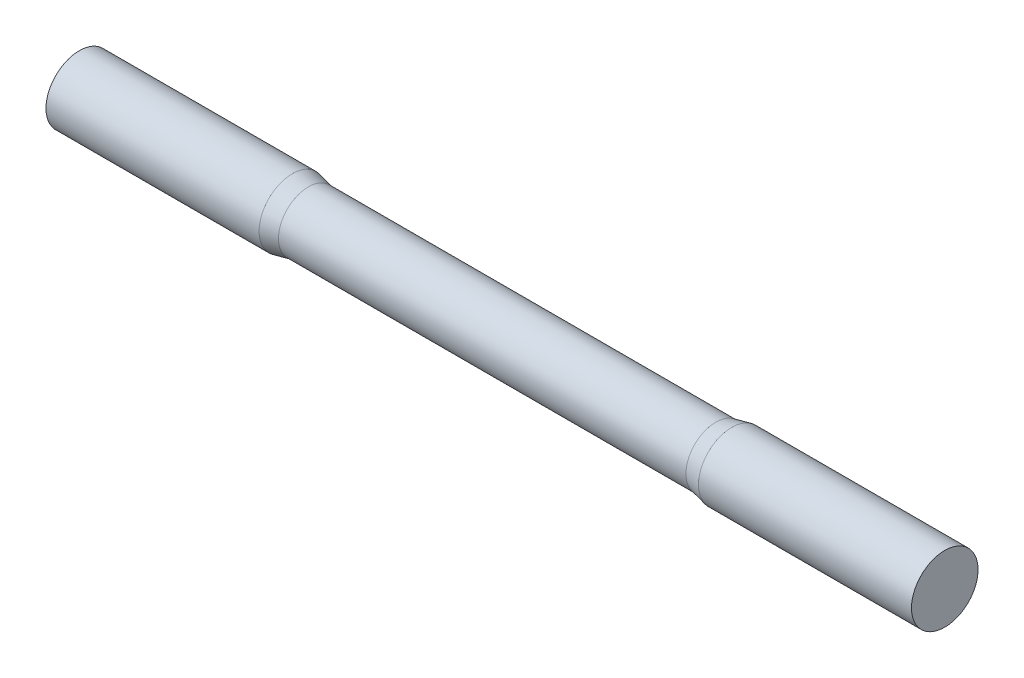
from build123d import *

# Parameters (mm, degrees)
SKETCH2_R      = 2.24
BASEBODY_DEPTH = 65


with BuildPart() as part:
    # Sketch2 → BaseBody (new body)
    with BuildSketch(Plane(origin=(0, 0, 0), x_dir=(0, 0, -1), z_dir=(1, 0, 0))):
        Circle(SKETCH2_R)
    extrude(amount=BASEBODY_DEPTH)

    # Sketch3 → BaseHead (revolve)
    with BuildSketch(Plane.XY, mode=Mode.PRIVATE) as basehead_sk:
        Polygon((65, 2.5), (65, 0), (47.8, 0), (47.8, 2.24), (49, 2.5), align=None)
    revolve(basehead_sk.sketch.rotate(Axis((-0.442011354, 0, 0), (1, 0, 0)), 270), axis=Axis((-0.442011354, 0, 0), (1, 0, 0)))

    # Sketch6 → BaseEnd (revolve)
    with BuildSketch(Plane.XY, mode=Mode.PRIVATE) as baseend_sk:
        Polygon((0, 0), (0, 2.5), (16, 2.5), (17.2, 2.24), (17.2, 0), align=None)
    revolve(baseend_sk.sketch.rotate(Axis((-0.377128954, 0, 0), (1, 0, 0)), 90), axis=Axis((-0.377128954, 0, 0), (1, 0, 0)))


solid = part.part
